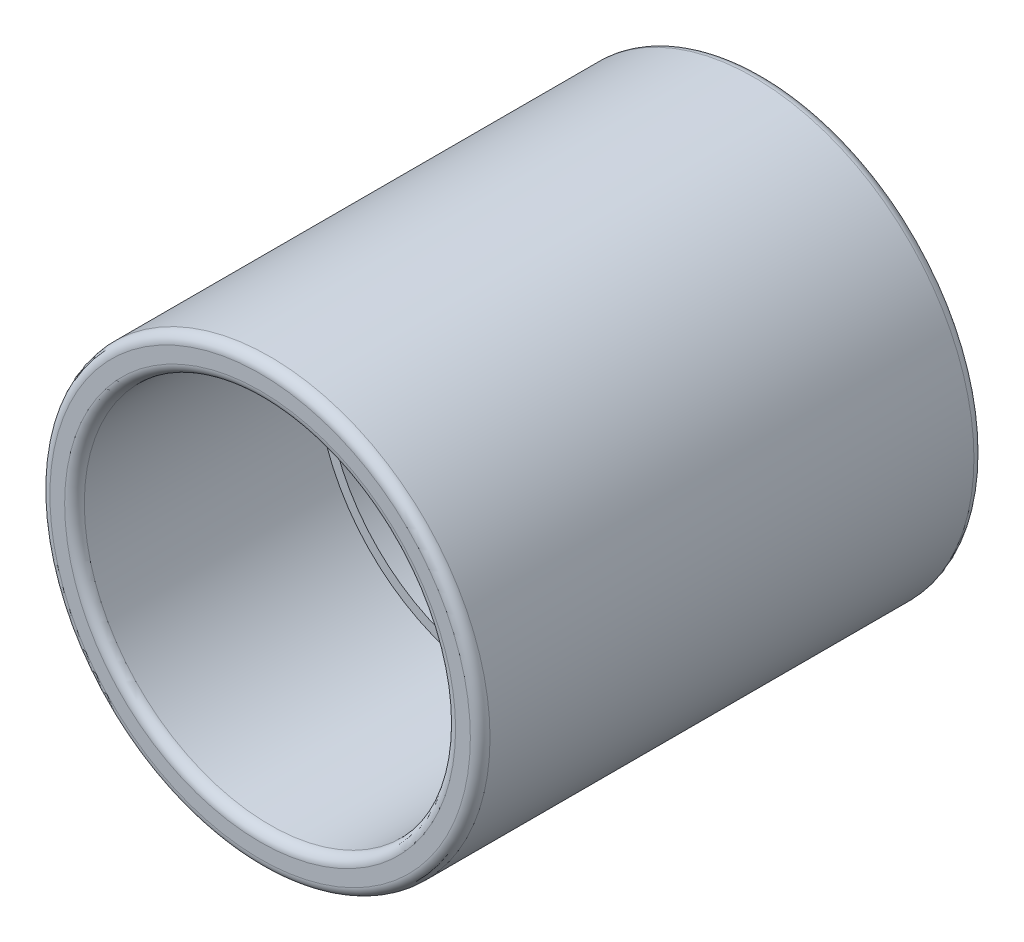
ISO-10303-21;
HEADER;
FILE_DESCRIPTION(('STEP AP214'),'2;1');
FILE_NAME('part.step','',(''),(''),'','','');
FILE_SCHEMA(('AUTOMOTIVE_DESIGN { 1 0 10303 214 1 1 1 1 }'));
ENDSEC;
DATA;
#1=APPLICATION_CONTEXT('core data for automotive mechanical design processes');
#2=APPLICATION_PROTOCOL_DEFINITION('international standard','automotive_design',2000,#1);
#3=PRODUCT_CONTEXT('',#1,'mechanical');
#4=PRODUCT('Part','Part','',(#3));
#5=PRODUCT_RELATED_PRODUCT_CATEGORY('part','',(#4));
#6=PRODUCT_DEFINITION_FORMATION('','',#4);
#7=PRODUCT_DEFINITION_CONTEXT('part definition',#1,'design');
#8=PRODUCT_DEFINITION('design','',#6,#7);
#9=PRODUCT_DEFINITION_SHAPE('','',#8);
#10=(LENGTH_UNIT() NAMED_UNIT(*) SI_UNIT(.MILLI.,.METRE.));
#11=(NAMED_UNIT(*) PLANE_ANGLE_UNIT() SI_UNIT($,.RADIAN.));
#12=(NAMED_UNIT(*) SI_UNIT($,.STERADIAN.) SOLID_ANGLE_UNIT());
#13=UNCERTAINTY_MEASURE_WITH_UNIT(LENGTH_MEASURE(1.E-05),#10,'distance_accuracy_value','');
#14=(GEOMETRIC_REPRESENTATION_CONTEXT(3) GLOBAL_UNCERTAINTY_ASSIGNED_CONTEXT((#13)) GLOBAL_UNIT_ASSIGNED_CONTEXT((#10,
#11,#12)) REPRESENTATION_CONTEXT('',''));
#15=CARTESIAN_POINT('',(0.,0.,0.));
#16=DIRECTION('',(0.,0.,1.));
#17=DIRECTION('',(1.,0.,0.));
#18=AXIS2_PLACEMENT_3D('',#15,#16,#17);
#19=CARTESIAN_POINT('',(0.,0.,32.512));
#20=DIRECTION('',(0.,0.,-1.));
#21=DIRECTION('',(-1.,0.,0.));
#22=AXIS2_PLACEMENT_3D('',#19,#20,#21);
#23=CYLINDRICAL_SURFACE('',#22,23.97125);
#24=CARTESIAN_POINT('',(0.,0.,-31.242));
#25=DIRECTION('',(0.,0.,1.));
#26=DIRECTION('',(1.,0.,0.));
#27=AXIS2_PLACEMENT_3D('',#24,#25,#26);
#28=CIRCLE('',#27,23.97125);
#29=CARTESIAN_POINT('',(23.97125,0.,-31.242));
#30=VERTEX_POINT('',#29);
#31=EDGE_CURVE('E57',#30,#30,#28,.F.);
#32=ORIENTED_EDGE('',*,*,#31,.T.);
#33=EDGE_LOOP('',(#32));
#34=FACE_BOUND('',#33,.T.);
#35=CARTESIAN_POINT('',(0.,0.,-1.26999999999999));
#36=DIRECTION('',(0.,0.,1.));
#37=DIRECTION('',(1.,0.,0.));
#38=AXIS2_PLACEMENT_3D('',#35,#36,#37);
#39=CIRCLE('',#38,23.97125);
#40=CARTESIAN_POINT('',(23.97125,0.,-1.26999999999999));
#41=VERTEX_POINT('',#40);
#42=EDGE_CURVE('E72',#41,#41,#39,.T.);
#43=ORIENTED_EDGE('',*,*,#42,.T.);
#44=EDGE_LOOP('',(#43));
#45=FACE_BOUND('',#44,.T.);
#46=ADVANCED_FACE('F34',(#34,#45),#23,.F.);
#47=CARTESIAN_POINT('',(0.,0.,32.512));
#48=DIRECTION('',(0.,0.,1.));
#49=DIRECTION('',(1.,0.,0.));
#50=AXIS2_PLACEMENT_3D('',#47,#48,#49);
#51=PLANE('',#50);
#52=CARTESIAN_POINT('',(0.,0.,32.512));
#53=DIRECTION('',(0.,0.,1.));
#54=DIRECTION('',(1.,0.,0.));
#55=AXIS2_PLACEMENT_3D('',#52,#53,#54);
#56=CIRCLE('',#55,27.14625);
#57=CARTESIAN_POINT('',(27.14625,0.,32.512));
#58=VERTEX_POINT('',#57);
#59=EDGE_CURVE('E41',#58,#58,#56,.T.);
#60=ORIENTED_EDGE('',*,*,#59,.T.);
#61=EDGE_LOOP('',(#60));
#62=FACE_BOUND('',#61,.T.);
#63=CARTESIAN_POINT('',(0.,0.,32.512));
#64=DIRECTION('',(0.,0.,1.));
#65=DIRECTION('',(1.,0.,0.));
#66=AXIS2_PLACEMENT_3D('',#63,#64,#65);
#67=CIRCLE('',#66,25.24125);
#68=CARTESIAN_POINT('',(25.24125,0.,32.512));
#69=VERTEX_POINT('',#68);
#70=EDGE_CURVE('E45',#69,#69,#67,.F.);
#71=ORIENTED_EDGE('',*,*,#70,.T.);
#72=EDGE_LOOP('',(#71));
#73=FACE_BOUND('',#72,.T.);
#74=ADVANCED_FACE('F97',(#62,#73),#51,.T.);
#75=CARTESIAN_POINT('',(0.,0.,32.512));
#76=DIRECTION('',(0.,0.,-1.));
#77=DIRECTION('',(-1.,0.,0.));
#78=AXIS2_PLACEMENT_3D('',#75,#76,#77);
#79=CYLINDRICAL_SURFACE('',#78,28.41625);
#80=CARTESIAN_POINT('',(0.,0.,-31.242));
#81=DIRECTION('',(0.,0.,1.));
#82=DIRECTION('',(1.,0.,0.));
#83=AXIS2_PLACEMENT_3D('',#80,#81,#82);
#84=CIRCLE('',#83,28.41625);
#85=CARTESIAN_POINT('',(28.41625,0.,-31.242));
#86=VERTEX_POINT('',#85);
#87=EDGE_CURVE('E49',#86,#86,#84,.T.);
#88=ORIENTED_EDGE('',*,*,#87,.T.);
#89=EDGE_LOOP('',(#88));
#90=FACE_BOUND('',#89,.T.);
#91=CARTESIAN_POINT('',(0.,0.,31.242));
#92=DIRECTION('',(0.,0.,1.));
#93=DIRECTION('',(1.,0.,0.));
#94=AXIS2_PLACEMENT_3D('',#91,#92,#93);
#95=CIRCLE('',#94,28.41625);
#96=CARTESIAN_POINT('',(28.41625,0.,31.242));
#97=VERTEX_POINT('',#96);
#98=EDGE_CURVE('E54',#97,#97,#95,.F.);
#99=ORIENTED_EDGE('',*,*,#98,.T.);
#100=EDGE_LOOP('',(#99));
#101=FACE_BOUND('',#100,.T.);
#102=ADVANCED_FACE('F104',(#90,#101),#79,.T.);
#103=CARTESIAN_POINT('',(0.,0.,31.242));
#104=DIRECTION('',(0.,0.,1.));
#105=DIRECTION('',(1.,0.,0.));
#106=AXIS2_PLACEMENT_3D('',#103,#104,#105);
#107=CIRCLE('',#106,23.97125);
#108=CARTESIAN_POINT('',(23.97125,0.,31.242));
#109=VERTEX_POINT('',#108);
#110=EDGE_CURVE('E10',#109,#109,#107,.T.);
#111=ORIENTED_EDGE('',*,*,#110,.T.);
#112=EDGE_LOOP('',(#111));
#113=FACE_BOUND('',#112,.T.);
#114=CARTESIAN_POINT('',(0.,0.,1.26999999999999));
#115=DIRECTION('',(0.,0.,1.));
#116=DIRECTION('',(1.,0.,0.));
#117=AXIS2_PLACEMENT_3D('',#114,#115,#116);
#118=CIRCLE('',#117,23.97125);
#119=CARTESIAN_POINT('',(23.97125,0.,1.26999999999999));
#120=VERTEX_POINT('',#119);
#121=EDGE_CURVE('E66',#120,#120,#118,.T.);
#122=ORIENTED_EDGE('',*,*,#121,.F.);
#123=EDGE_LOOP('',(#122));
#124=FACE_BOUND('',#123,.T.);
#125=ADVANCED_FACE('F100',(#113,#124),#23,.F.);
#126=CARTESIAN_POINT('',(0.,0.,-32.512));
#127=DIRECTION('',(0.,0.,1.));
#128=DIRECTION('',(1.,0.,0.));
#129=AXIS2_PLACEMENT_3D('',#126,#127,#128);
#130=PLANE('',#129);
#131=CARTESIAN_POINT('',(0.,0.,-32.512));
#132=DIRECTION('',(0.,0.,1.));
#133=DIRECTION('',(1.,0.,0.));
#134=AXIS2_PLACEMENT_3D('',#131,#132,#133);
#135=CIRCLE('',#134,25.24125);
#136=CARTESIAN_POINT('',(25.24125,0.,-32.512));
#137=VERTEX_POINT('',#136);
#138=EDGE_CURVE('E60',#137,#137,#135,.T.);
#139=ORIENTED_EDGE('',*,*,#138,.T.);
#140=EDGE_LOOP('',(#139));
#141=FACE_BOUND('',#140,.T.);
#142=CARTESIAN_POINT('',(0.,0.,-32.512));
#143=DIRECTION('',(0.,0.,1.));
#144=DIRECTION('',(1.,0.,0.));
#145=AXIS2_PLACEMENT_3D('',#142,#143,#144);
#146=CIRCLE('',#145,27.14625);
#147=CARTESIAN_POINT('',(27.14625,0.,-32.512));
#148=VERTEX_POINT('',#147);
#149=EDGE_CURVE('E63',#148,#148,#146,.F.);
#150=ORIENTED_EDGE('',*,*,#149,.T.);
#151=EDGE_LOOP('',(#150));
#152=FACE_BOUND('',#151,.T.);
#153=ADVANCED_FACE('F93',(#141,#152),#130,.F.);
#154=CARTESIAN_POINT('',(0.,0.,1.26999999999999));
#155=DIRECTION('',(0.,0.,1.));
#156=DIRECTION('',(1.,0.,0.));
#157=AXIS2_PLACEMENT_3D('',#154,#155,#156);
#158=PLANE('',#157);
#159=ORIENTED_EDGE('',*,*,#121,.T.);
#160=EDGE_LOOP('',(#159));
#161=FACE_BOUND('',#160,.T.);
#162=CARTESIAN_POINT('',(0.,0.,1.26999999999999));
#163=DIRECTION('',(0.,0.,1.));
#164=DIRECTION('',(1.,0.,0.));
#165=AXIS2_PLACEMENT_3D('',#162,#163,#164);
#166=CIRCLE('',#165,22.70125);
#167=CARTESIAN_POINT('',(22.70125,0.,1.26999999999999));
#168=VERTEX_POINT('',#167);
#169=EDGE_CURVE('E69',#168,#168,#166,.T.);
#170=ORIENTED_EDGE('',*,*,#169,.F.);
#171=EDGE_LOOP('',(#170));
#172=FACE_BOUND('',#171,.T.);
#173=ADVANCED_FACE('F84',(#161,#172),#158,.T.);
#174=CARTESIAN_POINT('',(0.,0.,1.26999999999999));
#175=DIRECTION('',(0.,0.,-1.));
#176=DIRECTION('',(-1.,0.,0.));
#177=AXIS2_PLACEMENT_3D('',#174,#175,#176);
#178=CYLINDRICAL_SURFACE('',#177,22.70125);
#179=ORIENTED_EDGE('',*,*,#169,.T.);
#180=EDGE_LOOP('',(#179));
#181=FACE_BOUND('',#180,.T.);
#182=CARTESIAN_POINT('',(0.,0.,-1.26999999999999));
#183=DIRECTION('',(0.,0.,1.));
#184=DIRECTION('',(1.,0.,0.));
#185=AXIS2_PLACEMENT_3D('',#182,#183,#184);
#186=CIRCLE('',#185,22.70125);
#187=CARTESIAN_POINT('',(22.70125,0.,-1.26999999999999));
#188=VERTEX_POINT('',#187);
#189=EDGE_CURVE('E75',#188,#188,#186,.T.);
#190=ORIENTED_EDGE('',*,*,#189,.F.);
#191=EDGE_LOOP('',(#190));
#192=FACE_BOUND('',#191,.T.);
#193=ADVANCED_FACE('F82',(#181,#192),#178,.F.);
#194=CARTESIAN_POINT('',(0.,0.,-1.26999999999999));
#195=DIRECTION('',(0.,0.,1.));
#196=DIRECTION('',(1.,0.,0.));
#197=AXIS2_PLACEMENT_3D('',#194,#195,#196);
#198=PLANE('',#197);
#199=ORIENTED_EDGE('',*,*,#189,.T.);
#200=EDGE_LOOP('',(#199));
#201=FACE_BOUND('',#200,.T.);
#202=ORIENTED_EDGE('',*,*,#42,.F.);
#203=EDGE_LOOP('',(#202));
#204=FACE_BOUND('',#203,.T.);
#205=ADVANCED_FACE('F79',(#201,#204),#198,.F.);
#206=CARTESIAN_POINT('',(0.,0.,-31.242));
#207=DIRECTION('',(0.,0.,1.));
#208=DIRECTION('',(1.,0.,0.));
#209=AXIS2_PLACEMENT_3D('',#206,#207,#208);
#210=TOROIDAL_SURFACE('',#209,25.24125,1.27);
#211=ORIENTED_EDGE('',*,*,#31,.F.);
#212=EDGE_LOOP('',(#211));
#213=FACE_BOUND('',#212,.T.);
#214=ORIENTED_EDGE('',*,*,#138,.F.);
#215=EDGE_LOOP('',(#214));
#216=FACE_BOUND('',#215,.T.);
#217=ADVANCED_FACE('F91',(#213,#216),#210,.T.);
#218=CARTESIAN_POINT('',(0.,0.,-31.242));
#219=DIRECTION('',(0.,0.,1.));
#220=DIRECTION('',(1.,0.,0.));
#221=AXIS2_PLACEMENT_3D('',#218,#219,#220);
#222=TOROIDAL_SURFACE('',#221,27.14625,1.27);
#223=ORIENTED_EDGE('',*,*,#149,.F.);
#224=EDGE_LOOP('',(#223));
#225=FACE_BOUND('',#224,.T.);
#226=ORIENTED_EDGE('',*,*,#87,.F.);
#227=EDGE_LOOP('',(#226));
#228=FACE_BOUND('',#227,.T.);
#229=ADVANCED_FACE('F126',(#225,#228),#222,.T.);
#230=CARTESIAN_POINT('',(0.,0.,31.242));
#231=DIRECTION('',(0.,0.,1.));
#232=DIRECTION('',(1.,0.,0.));
#233=AXIS2_PLACEMENT_3D('',#230,#231,#232);
#234=TOROIDAL_SURFACE('',#233,27.14625,1.27);
#235=ORIENTED_EDGE('',*,*,#98,.F.);
#236=EDGE_LOOP('',(#235));
#237=FACE_BOUND('',#236,.T.);
#238=ORIENTED_EDGE('',*,*,#59,.F.);
#239=EDGE_LOOP('',(#238));
#240=FACE_BOUND('',#239,.T.);
#241=ADVANCED_FACE('F129',(#237,#240),#234,.T.);
#242=CARTESIAN_POINT('',(0.,0.,31.242));
#243=DIRECTION('',(0.,0.,1.));
#244=DIRECTION('',(1.,0.,0.));
#245=AXIS2_PLACEMENT_3D('',#242,#243,#244);
#246=TOROIDAL_SURFACE('',#245,25.24125,1.27);
#247=ORIENTED_EDGE('',*,*,#70,.F.);
#248=EDGE_LOOP('',(#247));
#249=FACE_BOUND('',#248,.T.);
#250=ORIENTED_EDGE('',*,*,#110,.F.);
#251=EDGE_LOOP('',(#250));
#252=FACE_BOUND('',#251,.T.);
#253=ADVANCED_FACE('F36',(#249,#252),#246,.T.);
#254=CLOSED_SHELL('',(#46,#74,#102,#125,#153,#173,#193,#205,#217,#229,#241,#253));
#255=MANIFOLD_SOLID_BREP('B2',#254);
#256=ADVANCED_BREP_SHAPE_REPRESENTATION('',(#18,#255),#14);
#257=SHAPE_DEFINITION_REPRESENTATION(#9,#256);
ENDSEC;
END-ISO-10303-21;
